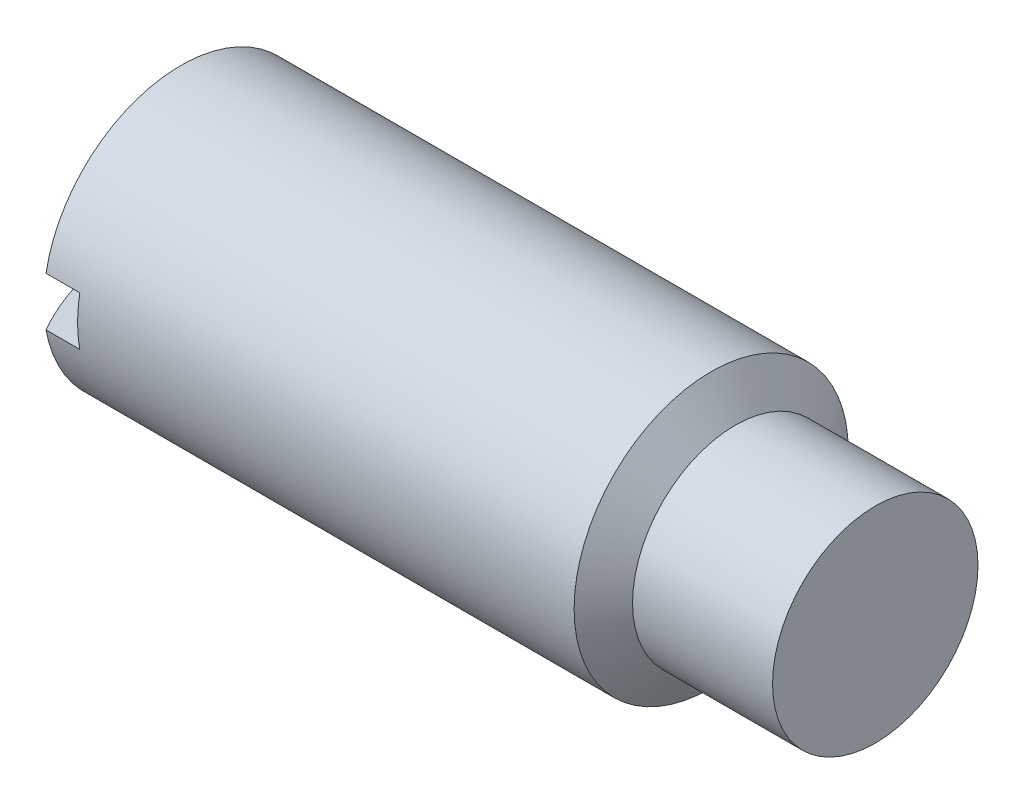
from build123d import *

# Parameters (mm, degrees)
SKETCH2_W  = 19.05
SKETCH2_H  = 3.4036
SLOT_DEPTH = 4.9022


with BuildPart() as part:
    # BodySke → BaseBody (revolve)
    with BuildSketch(Plane.XY, mode=Mode.PRIVATE) as basebody_sk:
        with BuildLine():
            Line((41.0718, 7.1374), (50.8, 7.1374))
            Line((50.8, 7.1374), (50.8, 0))
            Line((50.8, 0), (0, 0))
            ThreePointArc((0, 0), (0.649113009, 4.930502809), (2.552216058, 9.525))
            Line((2.552216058, 9.525), (39.399984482, 9.525))
            Line((39.399984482, 9.525), (41.0718, 7.1374))
        make_face()
    revolve(basebody_sk.sketch.rotate(Axis((-12.7, 0, 0), (1, 0, 0)), 90), axis=Axis((-12.7, 0, 0), (1, 0, 0)))

    # Sketch2 → Slot (cut)
    with BuildSketch(Plane(origin=(0, 0, 0), x_dir=(0, 0, -1), z_dir=(1, 0, 0))):
        Rectangle(SKETCH2_W, SKETCH2_H)
    extrude(amount=SLOT_DEPTH, mode=Mode.SUBTRACT)


solid = part.part
